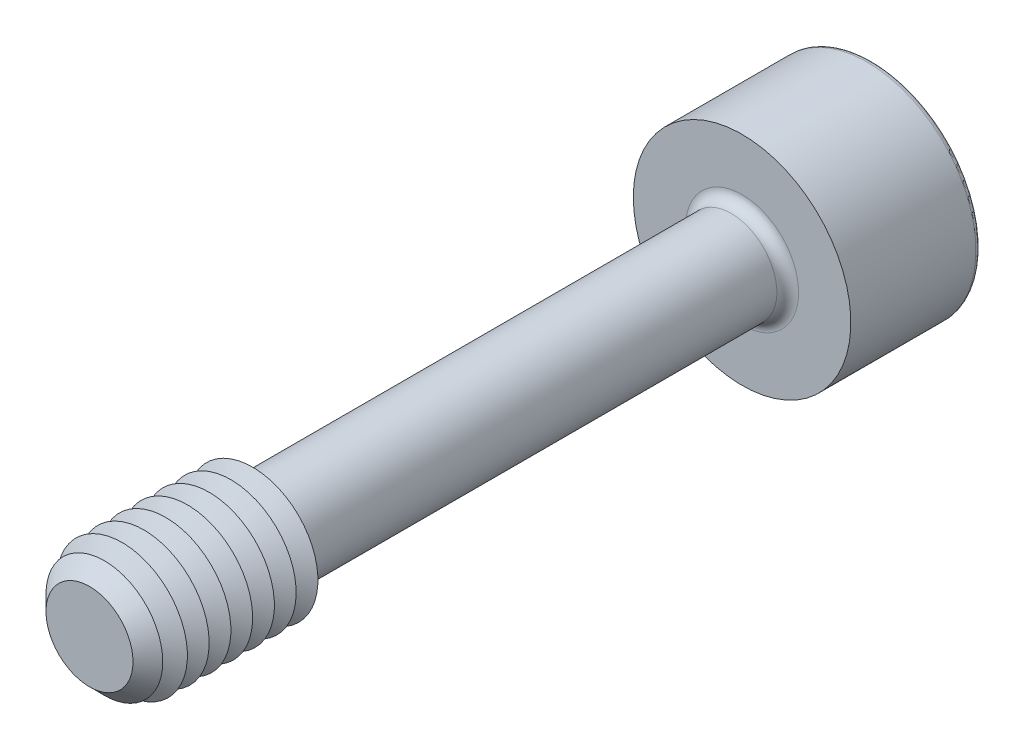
from build123d import *

# Parameters (mm, degrees)
SKETCH1_R       = 2.1
EXTRUDE1_DEPTH  = 15
CHAMFER1_SIZE   = 1
SKETCH3_R       = 5
EXTRUDE2_DEPTH  = 6
EXTRUDE3_DEPTH  = 5
FILLET1_R       = 0.5
FILLET2_R       = 0.25
LPATTERN1_COUNT = 7
LPATTERN1_PITCH = 1


with BuildPart() as part:
    # Sketch1 → Extrude1 (new, symmetric)
    with BuildSketch(Plane.XY):
        Circle(SKETCH1_R)
    extrude(amount=EXTRUDE1_DEPTH, both=True)

    # Sketch2 → Revolve1 (revolve)
    with BuildSketch(Plane(origin=(0, 0, 0), x_dir=(0, 0, -1), z_dir=(1, 0, 0))):
        Polygon((-15, 0), (-15, 3), (-7.5, 3), (-6.980384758, 2.1), (-6.980384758, 0), align=None)
    revolve(axis=Axis((0, 0, 6.980384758), (0, 0, 1)))

    # Chamfer1
    chamfer1_edges = [part.edges().sort_by_distance(p)[0] for p in [
        (0, -3, 15),
    ]]
    chamfer(chamfer1_edges, length=CHAMFER1_SIZE)

    # Sketch3 → Extrude2 (add)
    with BuildSketch(Plane(origin=(0, 0, -15), x_dir=(-1, 0, 0), z_dir=(0, 0, -1))):
        Circle(SKETCH3_R)
    extrude(amount=EXTRUDE2_DEPTH)

    # Sketch4 → Extrude3 (cut)
    with BuildSketch(Plane(origin=(-13.7, 0, -21), x_dir=(1, 0, 0), z_dir=(0, 0, 1))):
        Polygon((12.256624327, -2.5), (15.143375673, -2.5), (16.586751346, 0), (15.143375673, 2.5), (12.256624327, 2.5), (10.813248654, 0), align=None)
    extrude(amount=EXTRUDE3_DEPTH, mode=Mode.SUBTRACT)

    # Fillet1
    fillet1_edges = [part.edges().sort_by_distance(p)[0] for p in [
        (-2.1, 0, -15),
    ]]
    fillet(fillet1_edges, radius=FILLET1_R)

    # Fillet2
    fillet2_edges = [part.edges().sort_by_distance(p)[0] for p in [
        (5, 0, -21),
    ]]
    fillet(fillet2_edges, radius=FILLET2_R)

    # Sketch5 → Cut-Revolve1 (revolve, cut)
    with BuildSketch(Plane(origin=(0, 0, 0), x_dir=(0, 0, -1), z_dir=(1, 0, 0)), mode=Mode.PRIVATE) as cut_revolve1_sk:
        Polygon((16, 0), (16, -2.5), (14.556624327, 0), align=None)
    revolve(cut_revolve1_sk.sketch.rotate(Axis((0, 0, -14.556624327), (0, 0, -1)), 90), axis=Axis((0, 0, -14.556624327), (0, 0, -1)), mode=Mode.SUBTRACT)

    # Sketch7 → Cut-Revolve2 (revolve, cut)
    with BuildSketch(Plane(origin=(0, 0, 0), x_dir=(0, 0, -1), z_dir=(1, 0, 0)), mode=Mode.PRIVATE) as cut_revolve2_sk:
        Polygon((-7.5, 3), (-8, 2.133974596), (-8.5, 3), align=None)
    cut_revolve2 = revolve(cut_revolve2_sk.sketch.rotate(Axis((0, 0, -1.332048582), (0, 0, 1)), 90), axis=Axis((0, 0, -1.332048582), (0, 0, 1)), mode=Mode.SUBTRACT)

    # LPattern1: Cut-Revolve2 ×7
    with Locations(*[(0, 0, i * LPATTERN1_PITCH) for i in range(1, LPATTERN1_COUNT)]):
        add(cut_revolve2, mode=Mode.SUBTRACT)


solid = part.part
